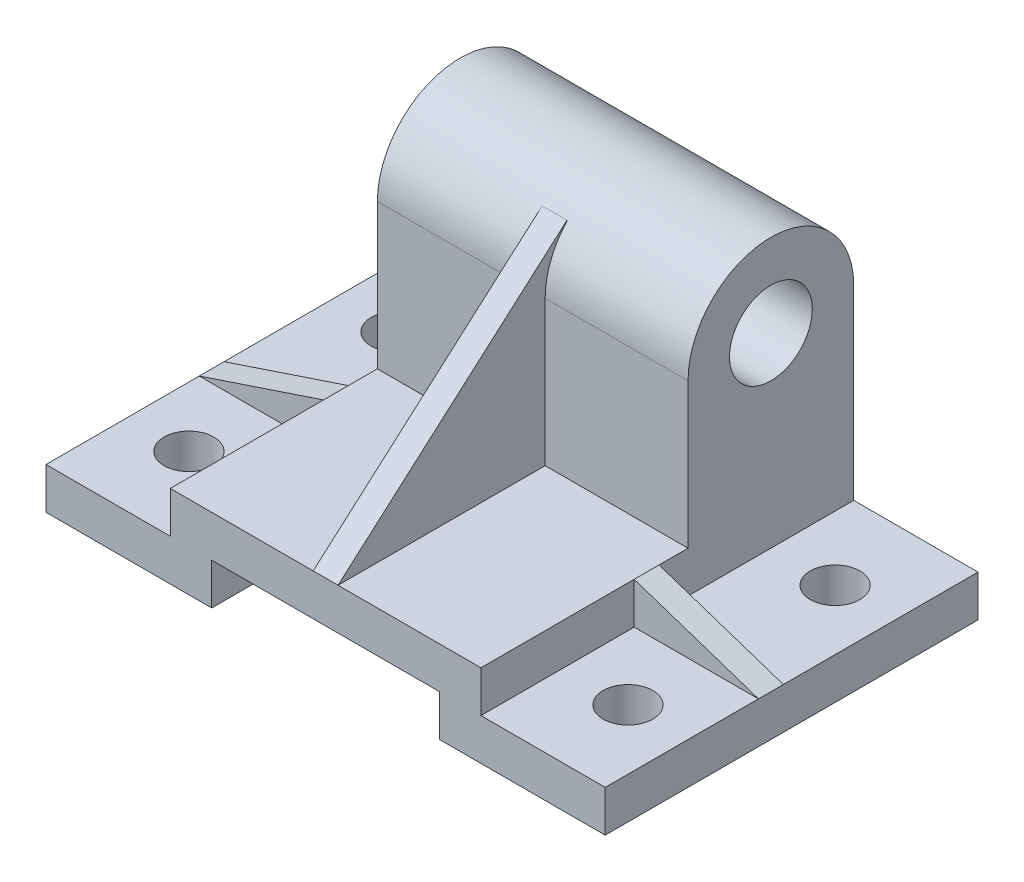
from build123d import *

# Parameters (mm, degrees)
CROQUIS2_W              = 135
CROQUIS2_H              = 90
CROQUIS2_R              = 6
SALIENTE_EXTRUIR1_DEPTH = 10
CROQUIS3_W              = 75
CROQUIS3_H              = 90
SALIENTE_EXTRUIR2_DEPTH = 10
CROQUIS4_W              = 55
CROQUIS4_H              = 20
CORTAR_EXTRUIR1_DEPTH   = 115.26394882
SALIENTE_EXTRUIR3_DEPTH = 6
CROQUIS11_R             = 10
SALIENTE_EXTRUIR4_DEPTH = 37.5
SALIENTE_EXTRUIR5_DEPTH = 3


with BuildPart() as part:
    # Croquis2 → Saliente-Extruir1 (new body)
    with BuildSketch(Plane(origin=(0, 0, 0), x_dir=(1, 0, 0), z_dir=(0, 1, 0))):
        Rectangle(CROQUIS2_W, CROQUIS2_H)
        with Locations(Location((-53, -25, 0), (0, 0, 270))):
            Circle(CROQUIS2_R, mode=Mode.SUBTRACT)
        with Locations(Location((53, -25, 0), (0, 0, 90))):
            Circle(CROQUIS2_R, mode=Mode.SUBTRACT)
        with Locations(Location((53, 25, 0), (0, 0, 270))):
            Circle(CROQUIS2_R, mode=Mode.SUBTRACT)
        with Locations(Location((-53, 25, 0), (0, 0, 90))):
            Circle(CROQUIS2_R, mode=Mode.SUBTRACT)
    extrude(amount=SALIENTE_EXTRUIR1_DEPTH)

    # Croquis3 → Saliente-Extruir2 (add)
    with BuildSketch(Plane(origin=(0, 10, 0), x_dir=(1, 0, 0), z_dir=(0, 1, 0))):
        Rectangle(CROQUIS3_W, CROQUIS3_H)
    extrude(amount=SALIENTE_EXTRUIR2_DEPTH)

    # Croquis4 → Cortar-Extruir1 (cut, through all)
    with BuildSketch(Plane.XY.offset(45)):
        Rectangle(CROQUIS4_W, CROQUIS4_H)
    extrude(amount=-CORTAR_EXTRUIR1_DEPTH, mode=Mode.SUBTRACT)

    # Croquis9 → Saliente-Extruir3 (add)
    with BuildSketch(Plane.XY.offset(8)):
        Polygon((37.5, 20), (37.5, 10), (67.5, 10), align=None)
    saliente_extruir3 = extrude(amount=-SALIENTE_EXTRUIR3_DEPTH)

    # Simetr_a1: Saliente-Extruir3 across plane
    add(saliente_extruir3.mirror(Plane(origin=(0, 0, 0), x_dir=(0, 0, 1), z_dir=(1, 0, 0))))

    # Croquis11 → Saliente-Extruir4 (add, symmetric)
    with BuildSketch(Plane(origin=(0, 0, 0), x_dir=(0, 0, -1), z_dir=(1, 0, 0))):
        with BuildLine():
            Line((45, 20), (45, 55))
            ThreePointArc((45, 55), (25, 75), (5, 55))
            Line((5, 55), (5, 20))
            Line((5, 20), (45, 20))
        make_face()
        with Locations((25, 55)):
            Circle(CROQUIS11_R, mode=Mode.SUBTRACT)
    extrude(amount=SALIENTE_EXTRUIR4_DEPTH, both=True)

    # Croquis12 → Saliente-Extruir5 (add, symmetric)
    with BuildSketch(Plane(origin=(0, 0, 0), x_dir=(0, 0, -1), z_dir=(1, 0, 0))):
        Polygon((-45, 20), (10.271335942, 68.678995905), (5, 20), align=None)
    extrude(amount=SALIENTE_EXTRUIR5_DEPTH, both=True)


solid = part.part
